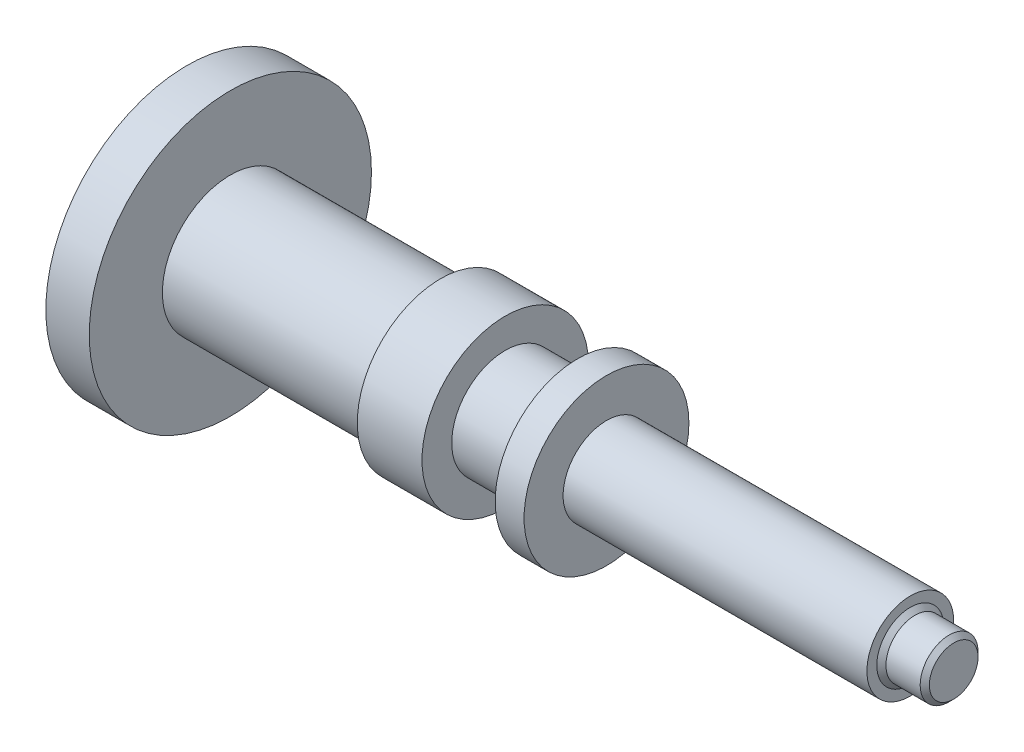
from build123d import *

# Parameters (mm, degrees)
CHAMFER1_SIZE = 1.5875


with BuildPart() as part:
    # Sketch1 → Revolve1 (revolve)
    with BuildSketch(Plane(origin=(0, 0, 0), x_dir=(-1, 0, 0), z_dir=(0, 0, -1)), mode=Mode.PRIVATE) as revolve1_sk:
        Polygon((275, 0), (275, 28.771028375), (265, 28.771028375), (265, 48.771028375), (250, 48.771028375), (250, 23.491173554), (180, 23.491173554), (177.36007259, 28.771028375), (155, 28.771028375), (155, 18.491173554), (130, 18.491173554), (130, 28.491173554), (120, 28.491173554), (120, 15), (15, 15), (15, 10), (0, 10), (0, 0), align=None)
    revolve(revolve1_sk.sketch.rotate(Axis((0, 0, 0), (-1, 0, 0)), 90), axis=Axis((0, 0, 0), (-1, 0, 0)))

    # Chamfer1
    chamfer1_edges = [part.edges().sort_by_distance(p)[0] for p in [
        (0, 0, 10),
        (-15, 0, 10),
        (-275, 0, 28.771028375),
    ]]
    chamfer(chamfer1_edges, length=CHAMFER1_SIZE)


solid = part.part
